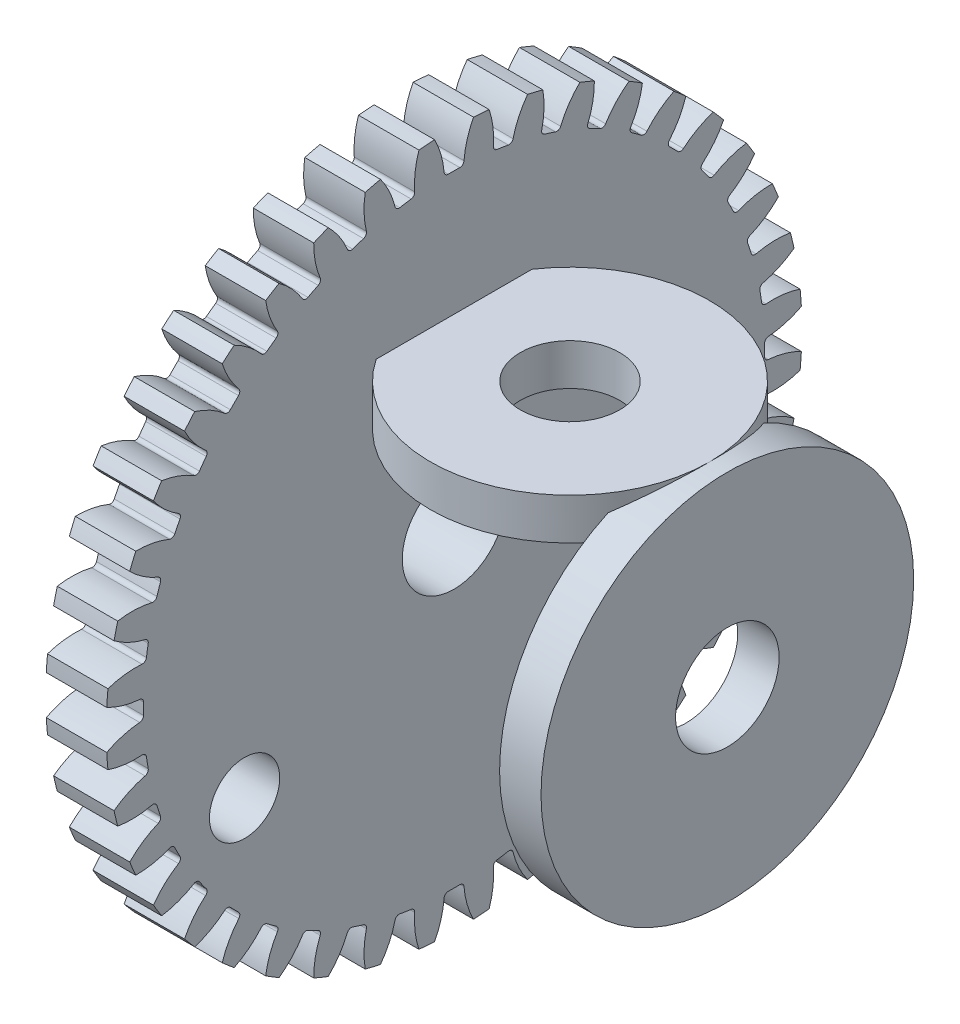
from build123d import *

# Parameters (mm, degrees)
ESQUISSE2_W                  = 43.46425091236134
ESQUISSE2_H                  = 20.00149257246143
ESQUISSE4_R                  = 90.00149257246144
ESQUISSE4_R_2                = 25
EXTRUSION1_DEPTH             = 20
ENL_V_MAT_EXTRU_1_DEPTH      = 288.107637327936
R_P_TITION_CIRCULAIRE1_COUNT = 40
ESQUISSE6_R                  = 16.97389545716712
ENL_V_MAT_EXTRU_2_DEPTH      = 272.4684042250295


with BuildPart() as part:
    # Esquisse1 → R_volution1 (revolve)
    with BuildSketch(Plane.XY, mode=Mode.PRIVATE) as r_volution1_sk:
        Polygon((-25.51162109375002, 25), (-95.51044921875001, 24.999999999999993), (-95.51044921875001, 50.722460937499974), (-83.70341796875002, 50.722460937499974), (-83.70341796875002, 36), (-54.70341796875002, 36), (-54.70341796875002, 168), (-25.511621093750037, 168), align=None)
    revolve(r_volution1_sk.sketch.rotate(Axis((0, 0, 0), (1, -1.8e-16, 0)), 180), axis=Axis((0, 0, 0), (1, -1.8e-16, 0)))

    # Esquisse2 → R_volution2 (revolve)
    with BuildSketch(Plane.XY):
        with Locations((-15.2437465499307, 80.00074628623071)):
            Rectangle(ESQUISSE2_W, ESQUISSE2_H)
    revolve(axis=Axis((30.488378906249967, 84.95119222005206, 0), (1.2e-16, -1, 0)))

    # Esquisse4 → Extrusion1 (add)
    with BuildSketch(Plane(origin=(86.48837890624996, -1.578e-14, 0), x_dir=(0, 0, -1), z_dir=(1, 0, 0))):
        with Locations(Location((0, 0, 0), (0, 0, 114.70944333))):
            Circle(ESQUISSE4_R)
        with Locations(Location((0, 0, 0), (0, 0, 270))):
            Circle(ESQUISSE4_R_2, mode=Mode.SUBTRACT)
    extrude(amount=EXTRUSION1_DEPTH)

    # Esquisse5 → Enl_v. mat.-Extru.1 (cut, through all)
    with BuildSketch(Plane.ZY.offset(54.70341796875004)):
        with BuildLine():
            ThreePointArc((-2.7787213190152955, 149.97426015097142), (-4.156931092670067, 150.4902426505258), (-4.809003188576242, 151.80952355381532))
            ThreePointArc((-4.809003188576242, 151.80952355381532), (-6.319313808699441, 160.0224322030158), (-9.424557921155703, 167.77422977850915))
            ThreePointArc((-9.424557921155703, 167.77422977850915), (1.029e-14, 168.0387290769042), (9.424557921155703, 167.77422977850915))
            ThreePointArc((9.424557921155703, 167.77422977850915), (6.319313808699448, 160.0224322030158), (4.809003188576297, 151.80952355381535))
            ThreePointArc((4.809003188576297, 151.80952355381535), (4.1569310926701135, 150.49024265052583), (2.77872131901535, 149.97426015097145))
            ThreePointArc((2.77872131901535, 149.97426015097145), (9.18e-15, 150.00000000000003), (-2.7787213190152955, 149.97426015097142))
        make_face()
    enl_v_mat_extru_1 = extrude(amount=-ENL_V_MAT_EXTRU_1_DEPTH, mode=Mode.SUBTRACT)

    # R_p_tition circulaire1: Enl_v. mat.-Extru.1 ×40 about axis
    r_p_tition_circulaire1_axis = Axis((0, -2.007e-14, -2.5e-16), (1, 0, 0))
    for i in range(1, R_P_TITION_CIRCULAIRE1_COUNT):
        add(enl_v_mat_extru_1.rotate(r_p_tition_circulaire1_axis, i * 360 / R_P_TITION_CIRCULAIRE1_COUNT), mode=Mode.SUBTRACT)

    # Esquisse6 → Enl_v. mat.-Extru.2 (cut, through all)
    with BuildSketch(Plane(origin=(-25.511621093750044, 4.66e-15, 0), x_dir=(0, 0, -1), z_dir=(1, -1.8e-16, 0))):
        with Locations(Location((-101.16271975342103, -61.72640527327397, 0), (0, 0, 90))):
            Circle(ESQUISSE6_R)
    extrude(amount=-ENL_V_MAT_EXTRU_2_DEPTH, mode=Mode.SUBTRACT)


solid = part.part
